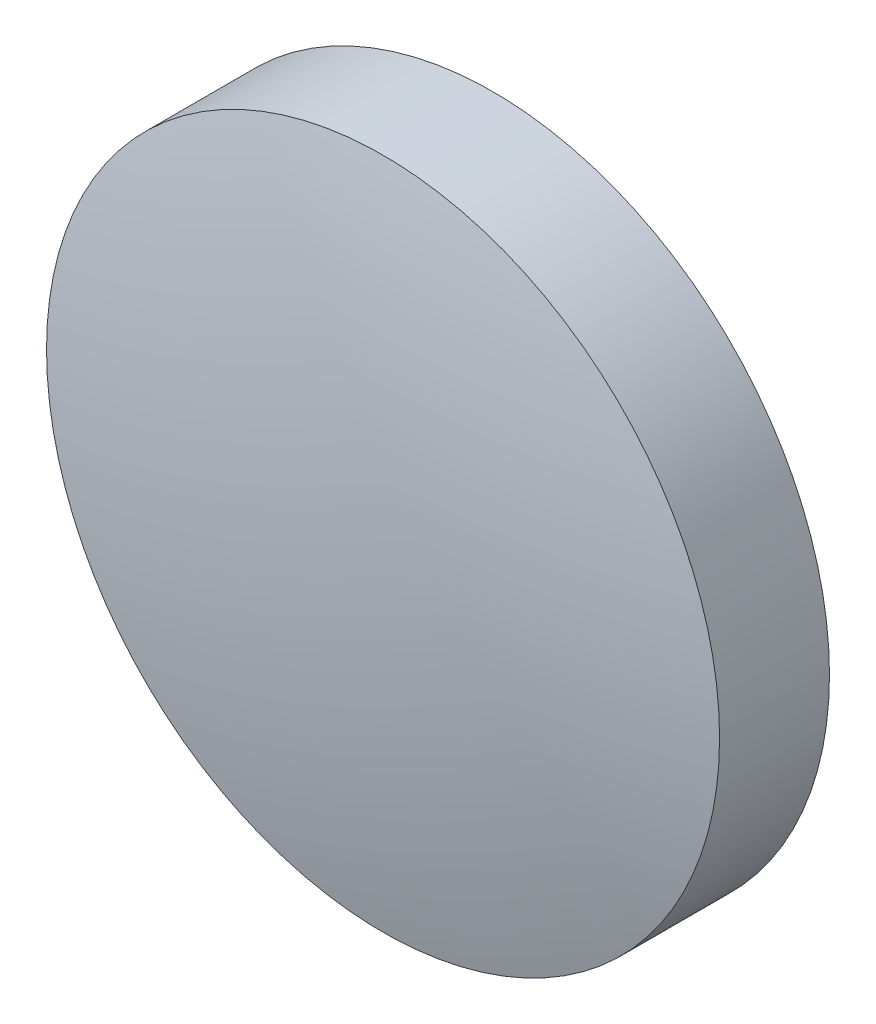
from build123d import *

# Parameters (mm, degrees)
SKETCH1_R           = 17
BOSS_EXTRUDE1_DEPTH = 5.552


with BuildPart() as part:
    # Sketch1 → Boss-Extrude1 (new body)
    with BuildSketch(Plane.XY):
        with Locations(Location((0, 0, 0), (0, 0, 180))):
            Circle(SKETCH1_R)
    extrude(amount=BOSS_EXTRUDE1_DEPTH)

    # Sketch2 → Revolve1 (revolve)
    with BuildSketch(Plane(origin=(0, 0, 0), x_dir=(1, 0, 0), z_dir=(0, 1, 0))):
        with BuildLine():
            Line((0, 0), (0, 2.466469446))
            ThreePointArc((0, 2.466469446), (8.588996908, 1.846640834), (17, 0))
            Line((17, 0), (0, 0))
        make_face()
    revolve(axis=Axis((0, 0, 0), (0, 0, -1)))

    # Sketch3 → Revolve2 (revolve)
    with BuildSketch(Plane(origin=(0, 0, 0), x_dir=(1, 0, 0), z_dir=(0, 1, 0))):
        with BuildLine():
            Line((17, -5.552), (0, -5.552))
            Line((0, -5.552), (0, -7.507926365))
            ThreePointArc((0, -7.507926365), (8.556074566, -7.017337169), (17, -5.552))
        make_face()
    revolve(axis=Axis((0, 0, 5.552), (0, 0, 1)))


solid = part.part
